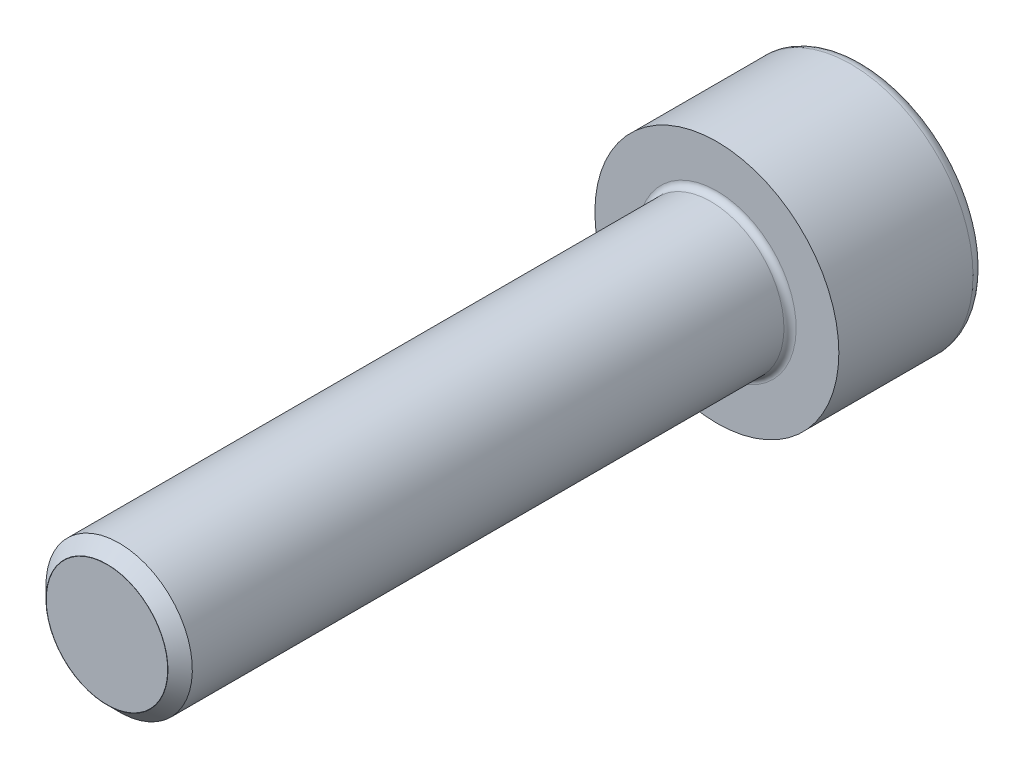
from build123d import *

# Parameters (mm, degrees)
CUT_EXTRUDE1_DEPTH = 3


with BuildPart() as part:
    # Sketch1 → Revolve1 (revolve)
    with BuildSketch(Plane(origin=(0, 0, 0), x_dir=(0, 0, -1), z_dir=(1, 0, 0))):
        with BuildLine():
            Line((-25, 0), (6, 0))
            Line((6, 0), (6, 4.5))
            ThreePointArc((6, 4.5), (5.853553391, 4.853553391), (5.5, 5))
            Line((5.5, 5), (0, 5))
            Line((0, 5), (0, 3.25))
            ThreePointArc((0, 3.25), (-0.073223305, 3.073223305), (-0.25, 3))
            Line((-0.25, 3), (-24.5, 3))
            Line((-24.5, 3), (-25, 2.5))
            Line((-25, 2.5), (-3, 2.5))
            Line((-3, 2.5), (-2.51, 2.99))
            Line((-2.51, 2.99), (-2.5, 2.99))
            Line((-2.5, 2.99), (-3, 2.49))
            Line((-3, 2.49), (-25, 2.49))
            Line((-25, 2.49), (-25, 0))
        make_face()
    revolve(axis=Axis((0, 0, 25), (0, 0, 1)))

    # Sketch2 → Cut-Extrude1 (cut)
    with BuildSketch(Plane(origin=(0, 0, -6), x_dir=(-1, 0, 0), z_dir=(0, 0, -1))):
        Polygon((1.443375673, -2.5), (2.886751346, 0), (1.443375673, 2.5), (-1.443375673, 2.5), (-2.886751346, 0), (-1.443375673, -2.5), align=None)
    extrude(amount=-CUT_EXTRUDE1_DEPTH, mode=Mode.SUBTRACT)


solid = part.part
